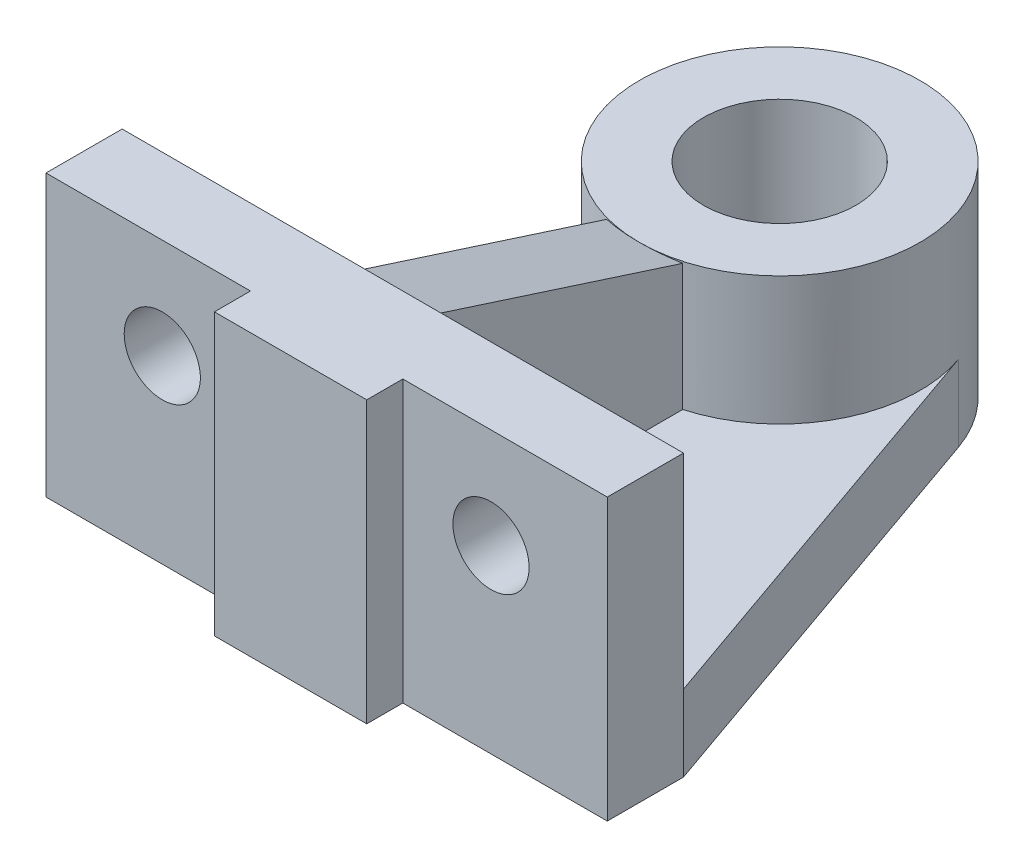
from build123d import *

# Parameters (mm, degrees)
SKETCH1_R           = 19
BOSS_EXTRUDE1_DEPTH = 19
SKETCH2_R           = 35
SKETCH2_R_2         = 19
BOSS_EXTRUDE2_DEPTH = 32
SKETCH3_W           = 140
SKETCH3_H           = 51
BOSS_EXTRUDE3_DEPTH = 19
SKETCH4_W           = 38
SKETCH4_H           = 9
BOSS_EXTRUDE4_DEPTH = 70
SKETCH5_R           = 9.5
CUT_EXTRUDE1_DEPTH  = 19
BOSS_EXTRUDE8_DEPTH = 9.5


with BuildPart() as part:
    # Sketch1 → Boss-Extrude1 (new body)
    with BuildSketch(Plane(origin=(0, 0, 0), x_dir=(1, 0, 0), z_dir=(0, 1, 0))):
        with BuildLine():
            Line((-70, -113), (70, -113))
            Line((70, -113), (70, -94))
            Line((70, -94), (33.033269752, 11.567328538))
            ThreePointArc((33.033269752, 11.567328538), (0, 35), (-33.033269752, 11.567328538))
            Line((-33.033269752, 11.567328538), (-70, -94))
            Line((-70, -94), (-70, -113))
        make_face()
        with Locations(Location((0, 0, 0), (0, 0, 270))):
            Circle(SKETCH1_R, mode=Mode.SUBTRACT)
    extrude(amount=BOSS_EXTRUDE1_DEPTH)

    # Sketch2 → Boss-Extrude2 (add)
    with BuildSketch(Plane(origin=(0, 19, 0), x_dir=(1, 0, 0), z_dir=(0, 1, 0))):
        with Locations(Location((0, 0, 0), (0, 0, 19.298828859))):
            Circle(SKETCH2_R)
        with Locations(Location((0, 0, 0), (0, 0, 270))):
            Circle(SKETCH2_R_2, mode=Mode.SUBTRACT)
    extrude(amount=BOSS_EXTRUDE2_DEPTH)

    # Sketch3 → Boss-Extrude3 (add)
    with BuildSketch(Plane.XY.offset(113)):
        with Locations((0, 44.5)):
            Rectangle(SKETCH3_W, SKETCH3_H)
    extrude(amount=-BOSS_EXTRUDE3_DEPTH)

    # Sketch4 → Boss-Extrude4 (add)
    with BuildSketch(Plane(origin=(0, 70, 0), x_dir=(1, 0, 0), z_dir=(0, 1, 0))):
        with Locations((0, -117.5)):
            Rectangle(SKETCH4_W, SKETCH4_H)
    extrude(amount=-BOSS_EXTRUDE4_DEPTH)

    # Sketch5 → Cut-Extrude1 (cut)
    with BuildSketch(Plane(origin=(0, 0, 94), x_dir=(-1, 0, 0), z_dir=(0, 0, -1))):
        with Locations((-41, 45)):
            Circle(SKETCH5_R)
        with Locations((41, 45)):
            Circle(SKETCH5_R)
    extrude(amount=-CUT_EXTRUDE1_DEPTH, mode=Mode.SUBTRACT)

    # Sketch6 → Boss-Extrude8 (add, symmetric)
    with BuildSketch(Plane(origin=(0, 0, 0), x_dir=(0, 0, -1), z_dir=(1, 0, 0))):
        Polygon((-94, 19), (-94, 70), (-35, 51), (-19, 45.847457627), (-19, 19), (-35, 19), align=None)
    extrude(amount=BOSS_EXTRUDE8_DEPTH, both=True)


solid = part.part
